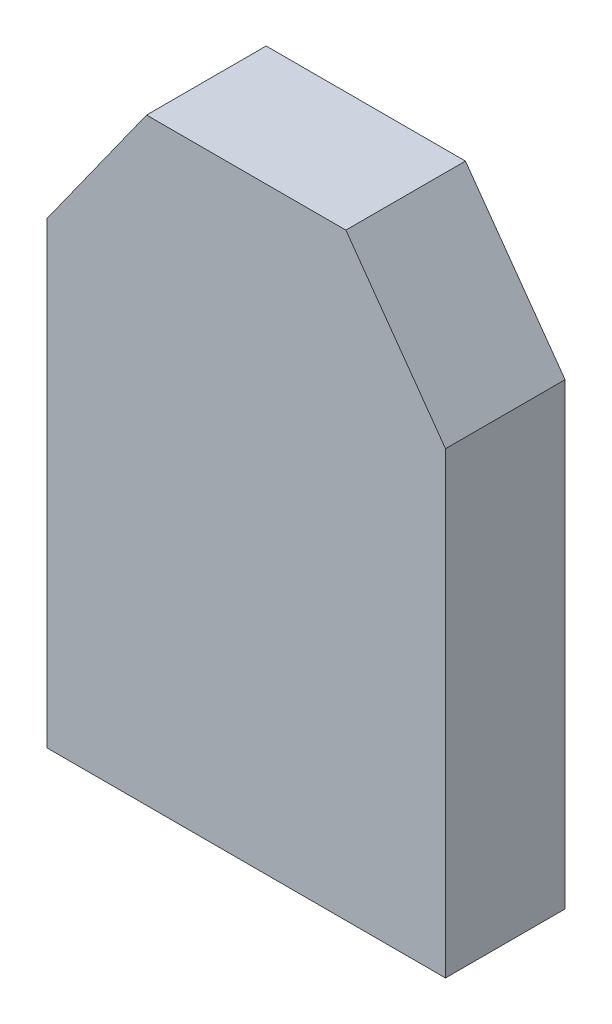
ISO-10303-21;
HEADER;
FILE_DESCRIPTION(('STEP AP214'),'2;1');
FILE_NAME('part.step','',(''),(''),'','','');
FILE_SCHEMA(('AUTOMOTIVE_DESIGN { 1 0 10303 214 1 1 1 1 }'));
ENDSEC;
DATA;
#1=APPLICATION_CONTEXT('core data for automotive mechanical design processes');
#2=APPLICATION_PROTOCOL_DEFINITION('international standard','automotive_design',2000,#1);
#3=PRODUCT_CONTEXT('',#1,'mechanical');
#4=PRODUCT('Part','Part','',(#3));
#5=PRODUCT_RELATED_PRODUCT_CATEGORY('part','',(#4));
#6=PRODUCT_DEFINITION_FORMATION('','',#4);
#7=PRODUCT_DEFINITION_CONTEXT('part definition',#1,'design');
#8=PRODUCT_DEFINITION('design','',#6,#7);
#9=PRODUCT_DEFINITION_SHAPE('','',#8);
#10=(LENGTH_UNIT() NAMED_UNIT(*) SI_UNIT(.MILLI.,.METRE.));
#11=(NAMED_UNIT(*) PLANE_ANGLE_UNIT() SI_UNIT($,.RADIAN.));
#12=(NAMED_UNIT(*) SI_UNIT($,.STERADIAN.) SOLID_ANGLE_UNIT());
#13=UNCERTAINTY_MEASURE_WITH_UNIT(LENGTH_MEASURE(1.E-05),#10,'distance_accuracy_value','');
#14=(GEOMETRIC_REPRESENTATION_CONTEXT(3) GLOBAL_UNCERTAINTY_ASSIGNED_CONTEXT((#13)) GLOBAL_UNIT_ASSIGNED_CONTEXT((#10,
#11,#12)) REPRESENTATION_CONTEXT('',''));
#15=CARTESIAN_POINT('',(0.,0.,0.));
#16=DIRECTION('',(0.,0.,1.));
#17=DIRECTION('',(1.,0.,0.));
#18=AXIS2_PLACEMENT_3D('',#15,#16,#17);
#19=CARTESIAN_POINT('',(-10.,60.,12.));
#20=DIRECTION('',(0.813733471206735,-0.581238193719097,0.));
#21=DIRECTION('',(0.581238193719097,0.813733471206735,0.));
#22=AXIS2_PLACEMENT_3D('',#19,#20,#21);
#23=PLANE('',#22);
#24=DIRECTION('',(-0.581238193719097,-0.813733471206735,0.));
#25=VECTOR('',#24,1.);
#26=CARTESIAN_POINT('',(-10.,60.,0.));
#27=LINE('',#26,#25);
#28=CARTESIAN_POINT('',(-10.,60.,0.));
#29=VERTEX_POINT('',#28);
#30=CARTESIAN_POINT('',(-20.,46.,0.));
#31=VERTEX_POINT('',#30);
#32=EDGE_CURVE('E115',#29,#31,#27,.T.);
#33=ORIENTED_EDGE('',*,*,#32,.T.);
#34=DIRECTION('',(0.,0.,-1.));
#35=VECTOR('',#34,1.);
#36=CARTESIAN_POINT('',(-20.,46.,12.));
#37=LINE('',#36,#35);
#38=CARTESIAN_POINT('',(-20.,46.,12.));
#39=VERTEX_POINT('',#38);
#40=EDGE_CURVE('E11',#39,#31,#37,.T.);
#41=ORIENTED_EDGE('',*,*,#40,.F.);
#42=DIRECTION('',(-0.581238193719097,-0.813733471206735,0.));
#43=VECTOR('',#42,1.);
#44=CARTESIAN_POINT('',(-10.,60.,12.));
#45=LINE('',#44,#43);
#46=CARTESIAN_POINT('',(-10.,60.,12.));
#47=VERTEX_POINT('',#46);
#48=EDGE_CURVE('E125',#47,#39,#45,.T.);
#49=ORIENTED_EDGE('',*,*,#48,.F.);
#50=DIRECTION('',(0.,0.,-1.));
#51=VECTOR('',#50,1.);
#52=CARTESIAN_POINT('',(-10.,60.,12.));
#53=LINE('',#52,#51);
#54=EDGE_CURVE('E111',#47,#29,#53,.T.);
#55=ORIENTED_EDGE('',*,*,#54,.T.);
#56=EDGE_LOOP('',(#33,#41,#49,#55));
#57=FACE_BOUND('',#56,.T.);
#58=ADVANCED_FACE('F31',(#57),#23,.F.);
#59=CARTESIAN_POINT('',(-20.,46.,12.));
#60=DIRECTION('',(1.,0.,0.));
#61=DIRECTION('',(0.,1.,0.));
#62=AXIS2_PLACEMENT_3D('',#59,#60,#61);
#63=PLANE('',#62);
#64=DIRECTION('',(0.,-1.,0.));
#65=VECTOR('',#64,1.);
#66=CARTESIAN_POINT('',(-20.,46.,0.));
#67=LINE('',#66,#65);
#68=CARTESIAN_POINT('',(-20.,0.,0.));
#69=VERTEX_POINT('',#68);
#70=EDGE_CURVE('E118',#31,#69,#67,.T.);
#71=ORIENTED_EDGE('',*,*,#70,.T.);
#72=DIRECTION('',(0.,0.,-1.));
#73=VECTOR('',#72,1.);
#74=CARTESIAN_POINT('',(-20.,0.,12.));
#75=LINE('',#74,#73);
#76=CARTESIAN_POINT('',(-20.,0.,12.));
#77=VERTEX_POINT('',#76);
#78=EDGE_CURVE('E39',#77,#69,#75,.T.);
#79=ORIENTED_EDGE('',*,*,#78,.F.);
#80=DIRECTION('',(0.,-1.,0.));
#81=VECTOR('',#80,1.);
#82=CARTESIAN_POINT('',(-20.,46.,12.));
#83=LINE('',#82,#81);
#84=EDGE_CURVE('E84',#39,#77,#83,.T.);
#85=ORIENTED_EDGE('',*,*,#84,.F.);
#86=ORIENTED_EDGE('',*,*,#40,.T.);
#87=EDGE_LOOP('',(#71,#79,#85,#86));
#88=FACE_BOUND('',#87,.T.);
#89=ADVANCED_FACE('F149',(#88),#63,.F.);
#90=CARTESIAN_POINT('',(-20.,0.,12.));
#91=DIRECTION('',(0.,1.,0.));
#92=DIRECTION('',(0.,0.,1.));
#93=AXIS2_PLACEMENT_3D('',#90,#91,#92);
#94=PLANE('',#93);
#95=DIRECTION('',(1.,0.,0.));
#96=VECTOR('',#95,1.);
#97=CARTESIAN_POINT('',(-20.,0.,0.));
#98=LINE('',#97,#96);
#99=CARTESIAN_POINT('',(20.,0.,0.));
#100=VERTEX_POINT('',#99);
#101=EDGE_CURVE('E120',#69,#100,#98,.T.);
#102=ORIENTED_EDGE('',*,*,#101,.T.);
#103=DIRECTION('',(0.,0.,-1.));
#104=VECTOR('',#103,1.);
#105=CARTESIAN_POINT('',(20.,0.,12.));
#106=LINE('',#105,#104);
#107=CARTESIAN_POINT('',(20.,0.,12.));
#108=VERTEX_POINT('',#107);
#109=EDGE_CURVE('E106',#108,#100,#106,.T.);
#110=ORIENTED_EDGE('',*,*,#109,.F.);
#111=DIRECTION('',(1.,0.,0.));
#112=VECTOR('',#111,1.);
#113=CARTESIAN_POINT('',(-20.,0.,12.));
#114=LINE('',#113,#112);
#115=EDGE_CURVE('E97',#77,#108,#114,.T.);
#116=ORIENTED_EDGE('',*,*,#115,.F.);
#117=ORIENTED_EDGE('',*,*,#78,.T.);
#118=EDGE_LOOP('',(#102,#110,#116,#117));
#119=FACE_BOUND('',#118,.T.);
#120=ADVANCED_FACE('F131',(#119),#94,.F.);
#121=CARTESIAN_POINT('',(20.,46.,12.));
#122=DIRECTION('',(-1.,0.,0.));
#123=DIRECTION('',(0.,-1.,0.));
#124=AXIS2_PLACEMENT_3D('',#121,#122,#123);
#125=PLANE('',#124);
#126=DIRECTION('',(0.,1.,0.));
#127=VECTOR('',#126,1.);
#128=CARTESIAN_POINT('',(20.,46.,0.));
#129=LINE('',#128,#127);
#130=CARTESIAN_POINT('',(20.,46.,0.));
#131=VERTEX_POINT('',#130);
#132=EDGE_CURVE('E105',#100,#131,#129,.T.);
#133=ORIENTED_EDGE('',*,*,#132,.T.);
#134=DIRECTION('',(0.,0.,-1.));
#135=VECTOR('',#134,1.);
#136=CARTESIAN_POINT('',(20.,46.,12.));
#137=LINE('',#136,#135);
#138=CARTESIAN_POINT('',(20.,46.,12.));
#139=VERTEX_POINT('',#138);
#140=EDGE_CURVE('E102',#139,#131,#137,.T.);
#141=ORIENTED_EDGE('',*,*,#140,.F.);
#142=DIRECTION('',(0.,1.,0.));
#143=VECTOR('',#142,1.);
#144=CARTESIAN_POINT('',(20.,46.,12.));
#145=LINE('',#144,#143);
#146=EDGE_CURVE('E91',#108,#139,#145,.T.);
#147=ORIENTED_EDGE('',*,*,#146,.F.);
#148=ORIENTED_EDGE('',*,*,#109,.T.);
#149=EDGE_LOOP('',(#133,#141,#147,#148));
#150=FACE_BOUND('',#149,.T.);
#151=ADVANCED_FACE('F103',(#150),#125,.F.);
#152=CARTESIAN_POINT('',(10.,60.,12.));
#153=DIRECTION('',(-0.813733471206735,-0.581238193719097,0.));
#154=DIRECTION('',(0.581238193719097,-0.813733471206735,0.));
#155=AXIS2_PLACEMENT_3D('',#152,#153,#154);
#156=PLANE('',#155);
#157=DIRECTION('',(-0.581238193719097,0.813733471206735,0.));
#158=VECTOR('',#157,1.);
#159=CARTESIAN_POINT('',(10.,60.,0.));
#160=LINE('',#159,#158);
#161=CARTESIAN_POINT('',(10.,60.,0.));
#162=VERTEX_POINT('',#161);
#163=EDGE_CURVE('E70',#131,#162,#160,.T.);
#164=ORIENTED_EDGE('',*,*,#163,.T.);
#165=DIRECTION('',(0.,0.,-1.));
#166=VECTOR('',#165,1.);
#167=CARTESIAN_POINT('',(10.,60.,12.));
#168=LINE('',#167,#166);
#169=CARTESIAN_POINT('',(10.,60.,12.));
#170=VERTEX_POINT('',#169);
#171=EDGE_CURVE('E107',#170,#162,#168,.T.);
#172=ORIENTED_EDGE('',*,*,#171,.F.);
#173=DIRECTION('',(-0.581238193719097,0.813733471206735,0.));
#174=VECTOR('',#173,1.);
#175=CARTESIAN_POINT('',(10.,60.,12.));
#176=LINE('',#175,#174);
#177=EDGE_CURVE('E95',#139,#170,#176,.T.);
#178=ORIENTED_EDGE('',*,*,#177,.F.);
#179=ORIENTED_EDGE('',*,*,#140,.T.);
#180=EDGE_LOOP('',(#164,#172,#178,#179));
#181=FACE_BOUND('',#180,.T.);
#182=ADVANCED_FACE('F109',(#181),#156,.F.);
#183=CARTESIAN_POINT('',(10.,60.,12.));
#184=DIRECTION('',(0.,-1.,0.));
#185=DIRECTION('',(0.,0.,-1.));
#186=AXIS2_PLACEMENT_3D('',#183,#184,#185);
#187=PLANE('',#186);
#188=DIRECTION('',(-1.,0.,0.));
#189=VECTOR('',#188,1.);
#190=CARTESIAN_POINT('',(10.,60.,0.));
#191=LINE('',#190,#189);
#192=EDGE_CURVE('E76',#162,#29,#191,.T.);
#193=ORIENTED_EDGE('',*,*,#192,.T.);
#194=ORIENTED_EDGE('',*,*,#54,.F.);
#195=DIRECTION('',(-1.,0.,0.));
#196=VECTOR('',#195,1.);
#197=CARTESIAN_POINT('',(10.,60.,12.));
#198=LINE('',#197,#196);
#199=EDGE_CURVE('E47',#170,#47,#198,.T.);
#200=ORIENTED_EDGE('',*,*,#199,.F.);
#201=ORIENTED_EDGE('',*,*,#171,.T.);
#202=EDGE_LOOP('',(#193,#194,#200,#201));
#203=FACE_BOUND('',#202,.T.);
#204=ADVANCED_FACE('F138',(#203),#187,.F.);
#205=CARTESIAN_POINT('',(0.,74.,12.));
#206=DIRECTION('',(0.,0.,1.));
#207=DIRECTION('',(1.,0.,0.));
#208=AXIS2_PLACEMENT_3D('',#205,#206,#207);
#209=PLANE('',#208);
#210=ORIENTED_EDGE('',*,*,#48,.T.);
#211=ORIENTED_EDGE('',*,*,#84,.T.);
#212=ORIENTED_EDGE('',*,*,#115,.T.);
#213=ORIENTED_EDGE('',*,*,#146,.T.);
#214=ORIENTED_EDGE('',*,*,#177,.T.);
#215=ORIENTED_EDGE('',*,*,#199,.T.);
#216=EDGE_LOOP('',(#210,#211,#212,#213,#214,#215));
#217=FACE_BOUND('',#216,.T.);
#218=ADVANCED_FACE('F93',(#217),#209,.T.);
#219=CARTESIAN_POINT('',(0.,74.,0.));
#220=DIRECTION('',(0.,0.,1.));
#221=DIRECTION('',(1.,0.,0.));
#222=AXIS2_PLACEMENT_3D('',#219,#220,#221);
#223=PLANE('',#222);
#224=ORIENTED_EDGE('',*,*,#32,.F.);
#225=ORIENTED_EDGE('',*,*,#192,.F.);
#226=ORIENTED_EDGE('',*,*,#163,.F.);
#227=ORIENTED_EDGE('',*,*,#132,.F.);
#228=ORIENTED_EDGE('',*,*,#101,.F.);
#229=ORIENTED_EDGE('',*,*,#70,.F.);
#230=EDGE_LOOP('',(#224,#225,#226,#227,#228,#229));
#231=FACE_BOUND('',#230,.T.);
#232=ADVANCED_FACE('F134',(#231),#223,.F.);
#233=CLOSED_SHELL('',(#58,#89,#120,#151,#182,#204,#218,#232));
#234=MANIFOLD_SOLID_BREP('B2',#233);
#235=ADVANCED_BREP_SHAPE_REPRESENTATION('',(#18,#234),#14);
#236=SHAPE_DEFINITION_REPRESENTATION(#9,#235);
ENDSEC;
END-ISO-10303-21;
